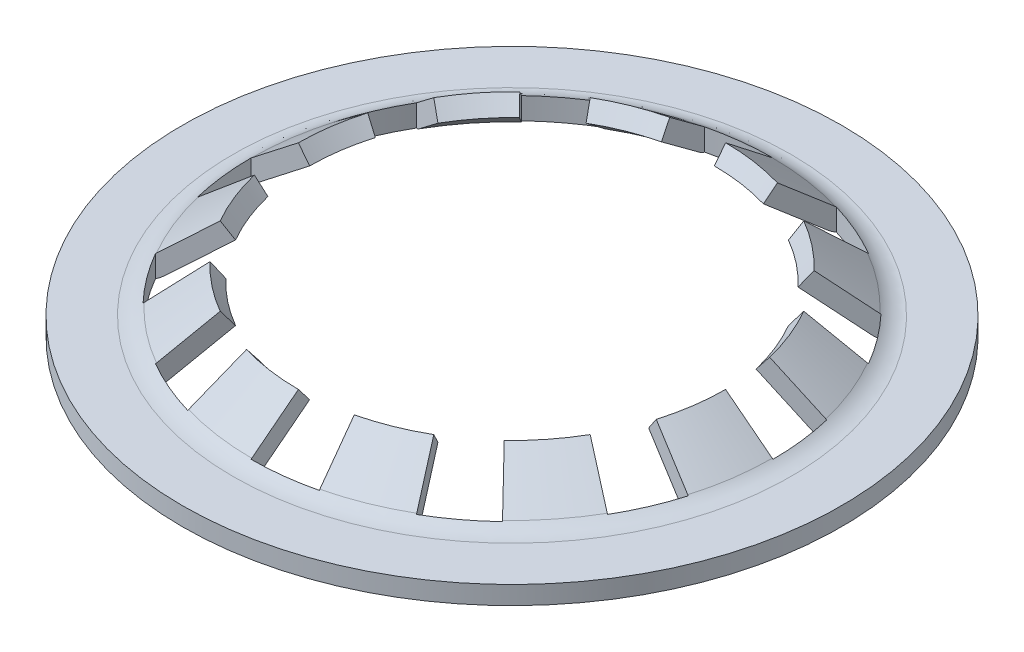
from build123d import *

# Parameters (mm, degrees)
ENL_V_MAT_EXTRU_1_DEPTH = 8.701947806


with BuildPart() as part:
    # Esquisse1 → Base-R_volution (revolve)
    with BuildSketch(Plane.XY, mode=Mode.PRIVATE) as base_r_volution_sk:
        with BuildLine():
            Line((4.46862155, 0), (5.4, 0))
            Line((5.4, 0), (5.4, 0.3))
            Line((5.4, 0.3), (4.571553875, 0.3))
            ThreePointArc((4.571553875, 0.3), (4.409285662, 0.3270634), (4.264583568, 0.405323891))
            Line((4.264583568, 0.405323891), (3.5, 1))
            Line((3.5, 1), (3.315817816, 0.763194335))
            Line((3.315817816, 0.763194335), (4.161651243, 0.105323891))
            ThreePointArc((4.161651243, 0.105323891), (4.306353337, 0.0270634), (4.46862155, 0))
        make_face()
    revolve(base_r_volution_sk.sketch.rotate(Axis((0, 8.734304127, 0), (0, -1, 0)), 90), axis=Axis((0, 8.734304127, 0), (0, -1, 0)))

    # Esquisse2 → Enl_v. mat.-Extru.1 (cut, through all)
    with BuildSketch(Plane.XZ):
        with BuildLine():
            Line((-1, -4.157746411), (-0.741565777, -3.083242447))
            ThreePointArc((-0.741565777, -3.083242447), (-1.175706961, -2.945168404), (-1.585583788, -2.74631168))
            Line((-1.585583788, -2.74631168), (-2.138156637, -3.70339593))
            ThreePointArc((-2.138156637, -3.70339593), (-2.559329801, -3.42588473), (-2.944898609, -3.100714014))
            Line((-2.944898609, -3.100714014), (-2.183836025, -2.299383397))
            ThreePointArc((-2.183836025, -2.299383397), (-2.490776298, -1.962737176), (-2.74631168, -1.585583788))
            Line((-2.74631168, -1.585583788), (-3.70339593, -2.138156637))
            ThreePointArc((-3.70339593, -2.138156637), (-3.92938699, -1.687238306), (-4.100714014, -1.212847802))
            Line((-4.100714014, -1.212847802), (-3.040949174, -0.899406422))
            ThreePointArc((-3.040949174, -0.899406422), (-3.138444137, -0.454392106), (-3.171167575, 0))
            Line((-3.171167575, 0), (-4.276313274, 0))
            ThreePointArc((-4.276313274, 0), (-4.246568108, 0.503502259), (-4.157746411, 1))
            Line((-4.157746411, 1), (-3.083242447, 0.741565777))
            ThreePointArc((-3.083242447, 0.741565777), (-2.945168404, 1.175706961), (-2.74631168, 1.585583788))
            Line((-2.74631168, 1.585583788), (-3.70339593, 2.138156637))
            ThreePointArc((-3.70339593, 2.138156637), (-3.42588473, 2.559329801), (-3.100714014, 2.944898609))
            Line((-3.100714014, 2.944898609), (-2.299383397, 2.183836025))
            ThreePointArc((-2.299383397, 2.183836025), (-1.962737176, 2.490776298), (-1.585583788, 2.74631168))
            Line((-1.585583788, 2.74631168), (-2.138156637, 3.70339593))
            ThreePointArc((-2.138156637, 3.70339593), (-1.687238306, 3.92938699), (-1.212847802, 4.100714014))
            Line((-1.212847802, 4.100714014), (-0.899406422, 3.040949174))
            ThreePointArc((-0.899406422, 3.040949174), (-0.454392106, 3.138444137), (0, 3.171167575))
            Line((0, 3.171167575), (0, 4.276313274))
            ThreePointArc((0, 4.276313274), (0.503502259, 4.246568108), (1, 4.157746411))
            Line((1, 4.157746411), (0.741565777, 3.083242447))
            ThreePointArc((0.741565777, 3.083242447), (1.175706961, 2.945168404), (1.585583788, 2.74631168))
            Line((1.585583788, 2.74631168), (2.138156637, 3.70339593))
            ThreePointArc((2.138156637, 3.70339593), (2.559329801, 3.42588473), (2.944898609, 3.100714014))
            Line((2.944898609, 3.100714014), (2.183836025, 2.299383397))
            ThreePointArc((2.183836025, 2.299383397), (2.490776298, 1.962737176), (2.74631168, 1.585583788))
            Line((2.74631168, 1.585583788), (3.70339593, 2.138156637))
            ThreePointArc((3.70339593, 2.138156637), (3.92938699, 1.687238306), (4.100714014, 1.212847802))
            Line((4.100714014, 1.212847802), (3.040949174, 0.899406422))
            ThreePointArc((3.040949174, 0.899406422), (3.138444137, 0.454392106), (3.171167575, 0))
            Line((3.171167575, 0), (4.276313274, 0))
            ThreePointArc((4.276313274, 0), (4.246568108, -0.503502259), (4.157746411, -1))
            Line((4.157746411, -1), (3.083242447, -0.741565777))
            ThreePointArc((3.083242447, -0.741565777), (2.945168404, -1.175706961), (2.74631168, -1.585583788))
            Line((2.74631168, -1.585583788), (3.70339593, -2.138156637))
            ThreePointArc((3.70339593, -2.138156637), (3.42588473, -2.559329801), (3.100714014, -2.944898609))
            Line((3.100714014, -2.944898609), (2.299383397, -2.183836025))
            ThreePointArc((2.299383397, -2.183836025), (1.962737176, -2.490776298), (1.585583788, -2.74631168))
            Line((1.585583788, -2.74631168), (2.138156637, -3.70339593))
            ThreePointArc((2.138156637, -3.70339593), (1.687238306, -3.92938699), (1.212847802, -4.100714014))
            Line((1.212847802, -4.100714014), (0.899406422, -3.040949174))
            ThreePointArc((0.899406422, -3.040949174), (0.454392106, -3.138444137), (0, -3.171167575))
            Line((0, -3.171167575), (0, -4.276313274))
            ThreePointArc((0, -4.276313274), (-0.503502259, -4.246568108), (-1, -4.157746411))
        make_face()
    extrude(amount=-ENL_V_MAT_EXTRU_1_DEPTH, mode=Mode.SUBTRACT)


solid = part.part
